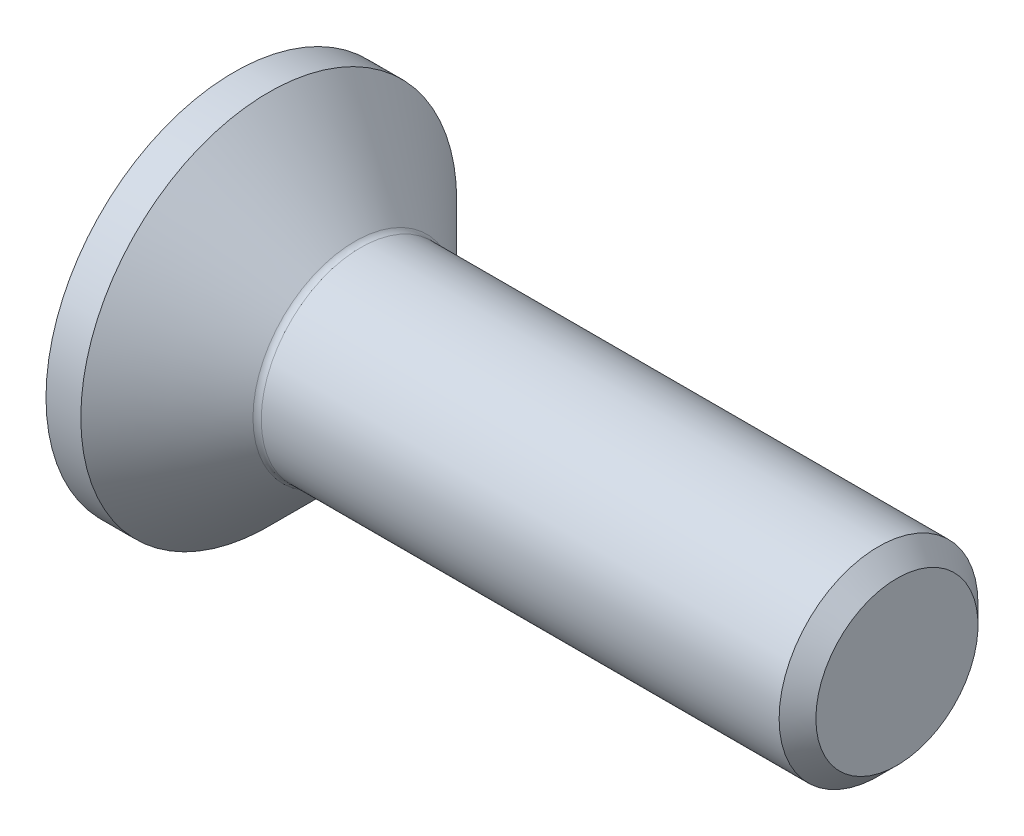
ISO-10303-21;
HEADER;
FILE_DESCRIPTION(('STEP AP214'),'2;1');
FILE_NAME('part.step','',(''),(''),'','','');
FILE_SCHEMA(('AUTOMOTIVE_DESIGN { 1 0 10303 214 1 1 1 1 }'));
ENDSEC;
DATA;
#1=APPLICATION_CONTEXT('core data for automotive mechanical design processes');
#2=APPLICATION_PROTOCOL_DEFINITION('international standard','automotive_design',2000,#1);
#3=PRODUCT_CONTEXT('',#1,'mechanical');
#4=PRODUCT('Part','Part','',(#3));
#5=PRODUCT_RELATED_PRODUCT_CATEGORY('part','',(#4));
#6=PRODUCT_DEFINITION_FORMATION('','',#4);
#7=PRODUCT_DEFINITION_CONTEXT('part definition',#1,'design');
#8=PRODUCT_DEFINITION('design','',#6,#7);
#9=PRODUCT_DEFINITION_SHAPE('','',#8);
#10=(LENGTH_UNIT() NAMED_UNIT(*) SI_UNIT(.MILLI.,.METRE.));
#11=(NAMED_UNIT(*) PLANE_ANGLE_UNIT() SI_UNIT($,.RADIAN.));
#12=(NAMED_UNIT(*) SI_UNIT($,.STERADIAN.) SOLID_ANGLE_UNIT());
#13=UNCERTAINTY_MEASURE_WITH_UNIT(LENGTH_MEASURE(1.E-05),#10,'distance_accuracy_value','');
#14=(GEOMETRIC_REPRESENTATION_CONTEXT(3) GLOBAL_UNCERTAINTY_ASSIGNED_CONTEXT((#13)) GLOBAL_UNIT_ASSIGNED_CONTEXT((#10,
#11,#12)) REPRESENTATION_CONTEXT('',''));
#15=CARTESIAN_POINT('',(0.,0.,0.));
#16=DIRECTION('',(0.,0.,1.));
#17=DIRECTION('',(1.,0.,0.));
#18=AXIS2_PLACEMENT_3D('',#15,#16,#17);
#19=CARTESIAN_POINT('',(0.,0.,0.));
#20=DIRECTION('',(-1.,0.,0.));
#21=DIRECTION('',(0.,0.,1.));
#22=AXIS2_PLACEMENT_3D('',#19,#20,#21);
#23=PLANE('',#22);
#24=CARTESIAN_POINT('',(0.,0.,0.));
#25=DIRECTION('',(-1.,0.,0.));
#26=DIRECTION('',(0.,0.,1.));
#27=AXIS2_PLACEMENT_3D('',#24,#25,#26);
#28=CIRCLE('',#27,5.67);
#29=CARTESIAN_POINT('',(0.,0.,5.67));
#30=VERTEX_POINT('',#29);
#31=EDGE_CURVE('E151',#30,#30,#28,.T.);
#32=ORIENTED_EDGE('',*,*,#31,.T.);
#33=EDGE_LOOP('',(#32));
#34=FACE_BOUND('',#33,.T.);
#35=DIRECTION('',(0.,-0.5,-0.866025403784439));
#36=VECTOR('',#35,1.);
#37=CARTESIAN_POINT('',(0.,-1.15470053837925,2.));
#38=LINE('',#37,#36);
#39=CARTESIAN_POINT('',(0.,-1.15470053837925,2.));
#40=VERTEX_POINT('',#39);
#41=CARTESIAN_POINT('',(0.,-2.3094010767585,0.));
#42=VERTEX_POINT('',#41);
#43=EDGE_CURVE('E117',#40,#42,#38,.T.);
#44=ORIENTED_EDGE('',*,*,#43,.T.);
#45=DIRECTION('',(0.,0.5,-0.866025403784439));
#46=VECTOR('',#45,1.);
#47=CARTESIAN_POINT('',(0.,-2.3094010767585,0.));
#48=LINE('',#47,#46);
#49=CARTESIAN_POINT('',(0.,-1.15470053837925,-2.));
#50=VERTEX_POINT('',#49);
#51=EDGE_CURVE('E48',#42,#50,#48,.T.);
#52=ORIENTED_EDGE('',*,*,#51,.T.);
#53=DIRECTION('',(0.,1.,0.));
#54=VECTOR('',#53,1.);
#55=CARTESIAN_POINT('',(0.,-1.15470053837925,-2.));
#56=LINE('',#55,#54);
#57=CARTESIAN_POINT('',(0.,1.15470053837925,-2.));
#58=VERTEX_POINT('',#57);
#59=EDGE_CURVE('E128',#50,#58,#56,.T.);
#60=ORIENTED_EDGE('',*,*,#59,.T.);
#61=DIRECTION('',(0.,0.5,0.866025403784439));
#62=VECTOR('',#61,1.);
#63=CARTESIAN_POINT('',(0.,1.15470053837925,-2.));
#64=LINE('',#63,#62);
#65=CARTESIAN_POINT('',(0.,2.3094010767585,0.));
#66=VERTEX_POINT('',#65);
#67=EDGE_CURVE('E252',#58,#66,#64,.T.);
#68=ORIENTED_EDGE('',*,*,#67,.T.);
#69=DIRECTION('',(0.,-0.5,0.866025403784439));
#70=VECTOR('',#69,1.);
#71=CARTESIAN_POINT('',(0.,2.3094010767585,0.));
#72=LINE('',#71,#70);
#73=CARTESIAN_POINT('',(0.,1.15470053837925,2.));
#74=VERTEX_POINT('',#73);
#75=EDGE_CURVE('E255',#66,#74,#72,.T.);
#76=ORIENTED_EDGE('',*,*,#75,.T.);
#77=DIRECTION('',(0.,-1.,0.));
#78=VECTOR('',#77,1.);
#79=CARTESIAN_POINT('',(0.,1.15470053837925,2.));
#80=LINE('',#79,#78);
#81=EDGE_CURVE('E258',#74,#40,#80,.T.);
#82=ORIENTED_EDGE('',*,*,#81,.T.);
#83=EDGE_LOOP('',(#44,#52,#60,#68,#76,#82));
#84=FACE_BOUND('',#83,.T.);
#85=ADVANCED_FACE('F33',(#34,#84),#23,.T.);
#86=CARTESIAN_POINT('',(0.,0.,0.));
#87=DIRECTION('',(-1.,0.,0.));
#88=DIRECTION('',(0.,0.,1.));
#89=AXIS2_PLACEMENT_3D('',#86,#87,#88);
#90=CYLINDRICAL_SURFACE('',#89,5.67);
#91=CARTESIAN_POINT('',(1.05000000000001,0.,0.));
#92=DIRECTION('',(-1.,0.,0.));
#93=DIRECTION('',(0.,0.,1.));
#94=AXIS2_PLACEMENT_3D('',#91,#92,#93);
#95=CIRCLE('',#94,5.67);
#96=CARTESIAN_POINT('',(1.05000000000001,0.,5.67));
#97=VERTEX_POINT('',#96);
#98=EDGE_CURVE('E148',#97,#97,#95,.T.);
#99=ORIENTED_EDGE('',*,*,#98,.T.);
#100=EDGE_LOOP('',(#99));
#101=FACE_BOUND('',#100,.T.);
#102=ORIENTED_EDGE('',*,*,#31,.F.);
#103=EDGE_LOOP('',(#102));
#104=FACE_BOUND('',#103,.T.);
#105=ADVANCED_FACE('F172',(#101,#104),#90,.T.);
#106=CARTESIAN_POINT('',(1.05000000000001,0.,0.));
#107=DIRECTION('',(-1.,0.,0.));
#108=DIRECTION('',(0.,0.,1.));
#109=AXIS2_PLACEMENT_3D('',#106,#107,#108);
#110=CONICAL_SURFACE('',#109,5.67,0.78539816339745);
#111=CARTESIAN_POINT('',(3.64677669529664,0.,0.));
#112=DIRECTION('',(-1.,0.,0.));
#113=DIRECTION('',(0.,0.,1.));
#114=AXIS2_PLACEMENT_3D('',#111,#112,#113);
#115=CIRCLE('',#114,3.07322330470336);
#116=CARTESIAN_POINT('',(3.64677669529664,0.,3.07322330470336));
#117=VERTEX_POINT('',#116);
#118=EDGE_CURVE('E41',#117,#117,#115,.T.);
#119=ORIENTED_EDGE('',*,*,#118,.T.);
#120=EDGE_LOOP('',(#119));
#121=FACE_BOUND('',#120,.T.);
#122=ORIENTED_EDGE('',*,*,#98,.F.);
#123=EDGE_LOOP('',(#122));
#124=FACE_BOUND('',#123,.T.);
#125=ADVANCED_FACE('F156',(#121,#124),#110,.T.);
#126=CARTESIAN_POINT('',(0.,0.,0.));
#127=DIRECTION('',(-1.,0.,0.));
#128=DIRECTION('',(0.,0.,1.));
#129=AXIS2_PLACEMENT_3D('',#126,#127,#128);
#130=CYLINDRICAL_SURFACE('',#129,2.99999999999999);
#131=CARTESIAN_POINT('',(3.82355339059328,0.,0.));
#132=DIRECTION('',(-1.,0.,0.));
#133=DIRECTION('',(0.,0.,1.));
#134=AXIS2_PLACEMENT_3D('',#131,#132,#133);
#135=CIRCLE('',#134,2.99999999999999);
#136=CARTESIAN_POINT('',(3.82355339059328,0.,2.99999999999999));
#137=VERTEX_POINT('',#136);
#138=EDGE_CURVE('E11',#137,#137,#135,.F.);
#139=ORIENTED_EDGE('',*,*,#138,.T.);
#140=EDGE_LOOP('',(#139));
#141=FACE_BOUND('',#140,.T.);
#142=CARTESIAN_POINT('',(19.4455,0.,0.));
#143=DIRECTION('',(-1.,0.,0.));
#144=DIRECTION('',(0.,0.,1.));
#145=AXIS2_PLACEMENT_3D('',#142,#143,#144);
#146=CIRCLE('',#145,2.99999999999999);
#147=CARTESIAN_POINT('',(19.4455,0.,2.99999999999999));
#148=VERTEX_POINT('',#147);
#149=EDGE_CURVE('E145',#148,#148,#146,.T.);
#150=ORIENTED_EDGE('',*,*,#149,.T.);
#151=EDGE_LOOP('',(#150));
#152=FACE_BOUND('',#151,.T.);
#153=ADVANCED_FACE('F183',(#141,#152),#130,.T.);
#154=CARTESIAN_POINT('',(20.,0.,0.));
#155=DIRECTION('',(-1.,0.,0.));
#156=DIRECTION('',(0.,0.,1.));
#157=AXIS2_PLACEMENT_3D('',#154,#155,#156);
#158=CONICAL_SURFACE('',#157,2.4455,0.785398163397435);
#159=ORIENTED_EDGE('',*,*,#149,.F.);
#160=EDGE_LOOP('',(#159));
#161=FACE_BOUND('',#160,.T.);
#162=CARTESIAN_POINT('',(20.,0.,0.));
#163=DIRECTION('',(-1.,0.,0.));
#164=DIRECTION('',(0.,0.,1.));
#165=AXIS2_PLACEMENT_3D('',#162,#163,#164);
#166=CIRCLE('',#165,2.4455);
#167=CARTESIAN_POINT('',(20.,0.,2.4455));
#168=VERTEX_POINT('',#167);
#169=EDGE_CURVE('E141',#168,#168,#166,.T.);
#170=ORIENTED_EDGE('',*,*,#169,.T.);
#171=EDGE_LOOP('',(#170));
#172=FACE_BOUND('',#171,.T.);
#173=ADVANCED_FACE('F167',(#161,#172),#158,.T.);
#174=CARTESIAN_POINT('',(20.,2.4455,0.));
#175=DIRECTION('',(1.,0.,0.));
#176=DIRECTION('',(0.,0.,-1.));
#177=AXIS2_PLACEMENT_3D('',#174,#175,#176);
#178=PLANE('',#177);
#179=ORIENTED_EDGE('',*,*,#169,.F.);
#180=EDGE_LOOP('',(#179));
#181=FACE_BOUND('',#180,.T.);
#182=ADVANCED_FACE('F160',(#181),#178,.T.);
#183=CARTESIAN_POINT('',(3.82355339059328,0.,0.));
#184=DIRECTION('',(-1.,0.,0.));
#185=DIRECTION('',(0.,0.,1.));
#186=AXIS2_PLACEMENT_3D('',#183,#184,#185);
#187=TOROIDAL_SURFACE('',#186,3.24999999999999,0.25);
#188=ORIENTED_EDGE('',*,*,#138,.F.);
#189=EDGE_LOOP('',(#188));
#190=FACE_BOUND('',#189,.T.);
#191=ORIENTED_EDGE('',*,*,#118,.F.);
#192=EDGE_LOOP('',(#191));
#193=FACE_BOUND('',#192,.T.);
#194=ADVANCED_FACE('F35',(#190,#193),#187,.F.);
#195=CARTESIAN_POINT('',(2.2,-2.3094010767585,0.));
#196=DIRECTION('',(0.,0.866025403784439,0.5));
#197=DIRECTION('',(0.,-0.5,0.866025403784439));
#198=AXIS2_PLACEMENT_3D('',#195,#196,#197);
#199=PLANE('',#198);
#200=ORIENTED_EDGE('',*,*,#51,.F.);
#201=DIRECTION('',(-1.,0.,0.));
#202=VECTOR('',#201,1.);
#203=CARTESIAN_POINT('',(2.2,-2.3094010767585,0.));
#204=LINE('',#203,#202);
#205=CARTESIAN_POINT('',(2.2,-2.3094010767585,0.));
#206=VERTEX_POINT('',#205);
#207=EDGE_CURVE('E249',#206,#42,#204,.T.);
#208=ORIENTED_EDGE('',*,*,#207,.F.);
#209=DIRECTION('',(0.,0.5,-0.866025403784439));
#210=VECTOR('',#209,1.);
#211=CARTESIAN_POINT('',(2.2,-2.3094010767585,0.));
#212=LINE('',#211,#210);
#213=CARTESIAN_POINT('',(2.2,-1.73205080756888,-1.));
#214=VERTEX_POINT('',#213);
#215=EDGE_CURVE('E113',#206,#214,#212,.T.);
#216=ORIENTED_EDGE('',*,*,#215,.T.);
#217=CARTESIAN_POINT('',(2.2,-1.15470053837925,-2.));
#218=VERTEX_POINT('',#217);
#219=EDGE_CURVE('E109',#214,#218,#212,.T.);
#220=ORIENTED_EDGE('',*,*,#219,.T.);
#221=DIRECTION('',(-1.,0.,0.));
#222=VECTOR('',#221,1.);
#223=CARTESIAN_POINT('',(2.2,-1.15470053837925,-2.));
#224=LINE('',#223,#222);
#225=EDGE_CURVE('E111',#218,#50,#224,.T.);
#226=ORIENTED_EDGE('',*,*,#225,.T.);
#227=EDGE_LOOP('',(#200,#208,#216,#220,#226));
#228=FACE_BOUND('',#227,.T.);
#229=ADVANCED_FACE('F110',(#228),#199,.T.);
#230=CARTESIAN_POINT('',(2.2,-1.15470053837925,-2.));
#231=DIRECTION('',(0.,0.,1.));
#232=DIRECTION('',(1.,0.,0.));
#233=AXIS2_PLACEMENT_3D('',#230,#231,#232);
#234=PLANE('',#233);
#235=ORIENTED_EDGE('',*,*,#59,.F.);
#236=ORIENTED_EDGE('',*,*,#225,.F.);
#237=DIRECTION('',(0.,1.,0.));
#238=VECTOR('',#237,1.);
#239=CARTESIAN_POINT('',(2.2,-1.15470053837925,-2.));
#240=LINE('',#239,#238);
#241=CARTESIAN_POINT('',(2.2,0.,-2.));
#242=VERTEX_POINT('',#241);
#243=EDGE_CURVE('E56',#218,#242,#240,.T.);
#244=ORIENTED_EDGE('',*,*,#243,.T.);
#245=CARTESIAN_POINT('',(2.2,1.15470053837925,-2.));
#246=VERTEX_POINT('',#245);
#247=EDGE_CURVE('E123',#242,#246,#240,.T.);
#248=ORIENTED_EDGE('',*,*,#247,.T.);
#249=DIRECTION('',(-1.,0.,0.));
#250=VECTOR('',#249,1.);
#251=CARTESIAN_POINT('',(2.2,1.15470053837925,-2.));
#252=LINE('',#251,#250);
#253=EDGE_CURVE('E130',#246,#58,#252,.T.);
#254=ORIENTED_EDGE('',*,*,#253,.T.);
#255=EDGE_LOOP('',(#235,#236,#244,#248,#254));
#256=FACE_BOUND('',#255,.T.);
#257=ADVANCED_FACE('F125',(#256),#234,.T.);
#258=CARTESIAN_POINT('',(2.2,1.15470053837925,-2.));
#259=DIRECTION('',(0.,-0.866025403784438,0.5));
#260=DIRECTION('',(0.,-0.5,-0.866025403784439));
#261=AXIS2_PLACEMENT_3D('',#258,#259,#260);
#262=PLANE('',#261);
#263=ORIENTED_EDGE('',*,*,#67,.F.);
#264=ORIENTED_EDGE('',*,*,#253,.F.);
#265=DIRECTION('',(0.,0.5,0.866025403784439));
#266=VECTOR('',#265,1.);
#267=CARTESIAN_POINT('',(2.2,1.15470053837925,-2.));
#268=LINE('',#267,#266);
#269=CARTESIAN_POINT('',(2.2,1.73205080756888,-1.));
#270=VERTEX_POINT('',#269);
#271=EDGE_CURVE('E230',#246,#270,#268,.T.);
#272=ORIENTED_EDGE('',*,*,#271,.T.);
#273=CARTESIAN_POINT('',(2.2,2.3094010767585,0.));
#274=VERTEX_POINT('',#273);
#275=EDGE_CURVE('E122',#270,#274,#268,.T.);
#276=ORIENTED_EDGE('',*,*,#275,.T.);
#277=DIRECTION('',(-1.,0.,0.));
#278=VECTOR('',#277,1.);
#279=CARTESIAN_POINT('',(2.2,2.3094010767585,0.));
#280=LINE('',#279,#278);
#281=EDGE_CURVE('E136',#274,#66,#280,.T.);
#282=ORIENTED_EDGE('',*,*,#281,.T.);
#283=EDGE_LOOP('',(#263,#264,#272,#276,#282));
#284=FACE_BOUND('',#283,.T.);
#285=ADVANCED_FACE('F197',(#284),#262,.T.);
#286=CARTESIAN_POINT('',(2.2,2.3094010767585,0.));
#287=DIRECTION('',(0.,-0.866025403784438,-0.5));
#288=DIRECTION('',(0.,0.5,-0.866025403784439));
#289=AXIS2_PLACEMENT_3D('',#286,#287,#288);
#290=PLANE('',#289);
#291=ORIENTED_EDGE('',*,*,#75,.F.);
#292=ORIENTED_EDGE('',*,*,#281,.F.);
#293=DIRECTION('',(0.,-0.5,0.866025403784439));
#294=VECTOR('',#293,1.);
#295=CARTESIAN_POINT('',(2.2,2.3094010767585,0.));
#296=LINE('',#295,#294);
#297=CARTESIAN_POINT('',(2.2,1.73205080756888,1.));
#298=VERTEX_POINT('',#297);
#299=EDGE_CURVE('E237',#274,#298,#296,.T.);
#300=ORIENTED_EDGE('',*,*,#299,.T.);
#301=CARTESIAN_POINT('',(2.2,1.15470053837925,2.));
#302=VERTEX_POINT('',#301);
#303=EDGE_CURVE('E235',#298,#302,#296,.T.);
#304=ORIENTED_EDGE('',*,*,#303,.T.);
#305=DIRECTION('',(-1.,0.,0.));
#306=VECTOR('',#305,1.);
#307=CARTESIAN_POINT('',(2.2,1.15470053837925,2.));
#308=LINE('',#307,#306);
#309=EDGE_CURVE('E267',#302,#74,#308,.T.);
#310=ORIENTED_EDGE('',*,*,#309,.T.);
#311=EDGE_LOOP('',(#291,#292,#300,#304,#310));
#312=FACE_BOUND('',#311,.T.);
#313=ADVANCED_FACE('F200',(#312),#290,.T.);
#314=CARTESIAN_POINT('',(2.2,1.15470053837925,2.));
#315=DIRECTION('',(0.,0.,-1.));
#316=DIRECTION('',(-1.,0.,0.));
#317=AXIS2_PLACEMENT_3D('',#314,#315,#316);
#318=PLANE('',#317);
#319=ORIENTED_EDGE('',*,*,#81,.F.);
#320=ORIENTED_EDGE('',*,*,#309,.F.);
#321=DIRECTION('',(0.,-1.,0.));
#322=VECTOR('',#321,1.);
#323=CARTESIAN_POINT('',(2.2,1.15470053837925,2.));
#324=LINE('',#323,#322);
#325=CARTESIAN_POINT('',(2.2,0.,2.));
#326=VERTEX_POINT('',#325);
#327=EDGE_CURVE('E242',#302,#326,#324,.T.);
#328=ORIENTED_EDGE('',*,*,#327,.T.);
#329=CARTESIAN_POINT('',(2.2,-1.15470053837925,2.));
#330=VERTEX_POINT('',#329);
#331=EDGE_CURVE('E241',#326,#330,#324,.T.);
#332=ORIENTED_EDGE('',*,*,#331,.T.);
#333=DIRECTION('',(-1.,0.,0.));
#334=VECTOR('',#333,1.);
#335=CARTESIAN_POINT('',(2.2,-1.15470053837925,2.));
#336=LINE('',#335,#334);
#337=EDGE_CURVE('E264',#330,#40,#336,.T.);
#338=ORIENTED_EDGE('',*,*,#337,.T.);
#339=EDGE_LOOP('',(#319,#320,#328,#332,#338));
#340=FACE_BOUND('',#339,.T.);
#341=ADVANCED_FACE('F204',(#340),#318,.T.);
#342=CARTESIAN_POINT('',(2.2,-1.15470053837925,2.));
#343=DIRECTION('',(0.,0.866025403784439,-0.5));
#344=DIRECTION('',(0.,0.5,0.866025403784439));
#345=AXIS2_PLACEMENT_3D('',#342,#343,#344);
#346=PLANE('',#345);
#347=ORIENTED_EDGE('',*,*,#43,.F.);
#348=ORIENTED_EDGE('',*,*,#337,.F.);
#349=DIRECTION('',(0.,-0.5,-0.866025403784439));
#350=VECTOR('',#349,1.);
#351=CARTESIAN_POINT('',(2.2,-1.15470053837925,2.));
#352=LINE('',#351,#350);
#353=CARTESIAN_POINT('',(2.2,-1.73205080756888,1.));
#354=VERTEX_POINT('',#353);
#355=EDGE_CURVE('E246',#330,#354,#352,.T.);
#356=ORIENTED_EDGE('',*,*,#355,.T.);
#357=EDGE_CURVE('E245',#354,#206,#352,.T.);
#358=ORIENTED_EDGE('',*,*,#357,.T.);
#359=ORIENTED_EDGE('',*,*,#207,.T.);
#360=EDGE_LOOP('',(#347,#348,#356,#358,#359));
#361=FACE_BOUND('',#360,.T.);
#362=ADVANCED_FACE('F208',(#361),#346,.T.);
#363=CARTESIAN_POINT('',(2.2,-1.15470053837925,-2.));
#364=DIRECTION('',(1.,0.,0.));
#365=DIRECTION('',(0.,0.,-1.));
#366=AXIS2_PLACEMENT_3D('',#363,#364,#365);
#367=PLANE('',#366);
#368=ORIENTED_EDGE('',*,*,#243,.F.);
#369=ORIENTED_EDGE('',*,*,#219,.F.);
#370=CARTESIAN_POINT('',(2.2,0.,0.));
#371=DIRECTION('',(-1.,0.,0.));
#372=DIRECTION('',(0.,0.,1.));
#373=AXIS2_PLACEMENT_3D('',#370,#371,#372);
#374=CIRCLE('',#373,2.);
#375=EDGE_CURVE('E120',#242,#214,#374,.T.);
#376=ORIENTED_EDGE('',*,*,#375,.F.);
#377=EDGE_LOOP('',(#368,#369,#376));
#378=FACE_BOUND('',#377,.T.);
#379=ADVANCED_FACE('F119',(#378),#367,.F.);
#380=ORIENTED_EDGE('',*,*,#215,.F.);
#381=ORIENTED_EDGE('',*,*,#357,.F.);
#382=EDGE_CURVE('E133',#214,#354,#374,.T.);
#383=ORIENTED_EDGE('',*,*,#382,.F.);
#384=EDGE_LOOP('',(#380,#381,#383));
#385=FACE_BOUND('',#384,.T.);
#386=ADVANCED_FACE('F214',(#385),#367,.F.);
#387=ORIENTED_EDGE('',*,*,#355,.F.);
#388=ORIENTED_EDGE('',*,*,#331,.F.);
#389=EDGE_CURVE('E129',#354,#326,#374,.T.);
#390=ORIENTED_EDGE('',*,*,#389,.F.);
#391=EDGE_LOOP('',(#387,#388,#390));
#392=FACE_BOUND('',#391,.T.);
#393=ADVANCED_FACE('F218',(#392),#367,.F.);
#394=ORIENTED_EDGE('',*,*,#327,.F.);
#395=ORIENTED_EDGE('',*,*,#303,.F.);
#396=EDGE_CURVE('E135',#326,#298,#374,.T.);
#397=ORIENTED_EDGE('',*,*,#396,.F.);
#398=EDGE_LOOP('',(#394,#395,#397));
#399=FACE_BOUND('',#398,.T.);
#400=ADVANCED_FACE('F226',(#399),#367,.F.);
#401=ORIENTED_EDGE('',*,*,#299,.F.);
#402=ORIENTED_EDGE('',*,*,#275,.F.);
#403=EDGE_CURVE('E142',#298,#270,#374,.T.);
#404=ORIENTED_EDGE('',*,*,#403,.F.);
#405=EDGE_LOOP('',(#401,#402,#404));
#406=FACE_BOUND('',#405,.T.);
#407=ADVANCED_FACE('F221',(#406),#367,.F.);
#408=ORIENTED_EDGE('',*,*,#271,.F.);
#409=ORIENTED_EDGE('',*,*,#247,.F.);
#410=EDGE_CURVE('E231',#270,#242,#374,.T.);
#411=ORIENTED_EDGE('',*,*,#410,.F.);
#412=EDGE_LOOP('',(#408,#409,#411));
#413=FACE_BOUND('',#412,.T.);
#414=ADVANCED_FACE('F192',(#413),#367,.F.);
#415=CARTESIAN_POINT('',(2.2,0.,0.));
#416=DIRECTION('',(-1.,0.,0.));
#417=DIRECTION('',(0.,0.,1.));
#418=AXIS2_PLACEMENT_3D('',#415,#416,#417);
#419=CONICAL_SURFACE('',#418,2.,1.04719755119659);
#420=CARTESIAN_POINT('',(3.35470053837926,0.,0.));
#421=VERTEX_POINT('',#420);
#422=VERTEX_LOOP('',#421);
#423=FACE_BOUND('',#422,.T.);
#424=ORIENTED_EDGE('',*,*,#396,.T.);
#425=ORIENTED_EDGE('',*,*,#403,.T.);
#426=ORIENTED_EDGE('',*,*,#410,.T.);
#427=ORIENTED_EDGE('',*,*,#375,.T.);
#428=ORIENTED_EDGE('',*,*,#382,.T.);
#429=ORIENTED_EDGE('',*,*,#389,.T.);
#430=EDGE_LOOP('',(#424,#425,#426,#427,#428,#429));
#431=FACE_BOUND('',#430,.T.);
#432=ADVANCED_FACE('F190',(#423,#431),#419,.F.);
#433=CLOSED_SHELL('',(#85,#105,#125,#153,#173,#182,#194,#229,#257,#285,#313,#341,#362,#379,#386,
#393,#400,#407,#414,#432));
#434=MANIFOLD_SOLID_BREP('B2',#433);
#435=ADVANCED_BREP_SHAPE_REPRESENTATION('',(#18,#434),#14);
#436=SHAPE_DEFINITION_REPRESENTATION(#9,#435);
ENDSEC;
END-ISO-10303-21;
